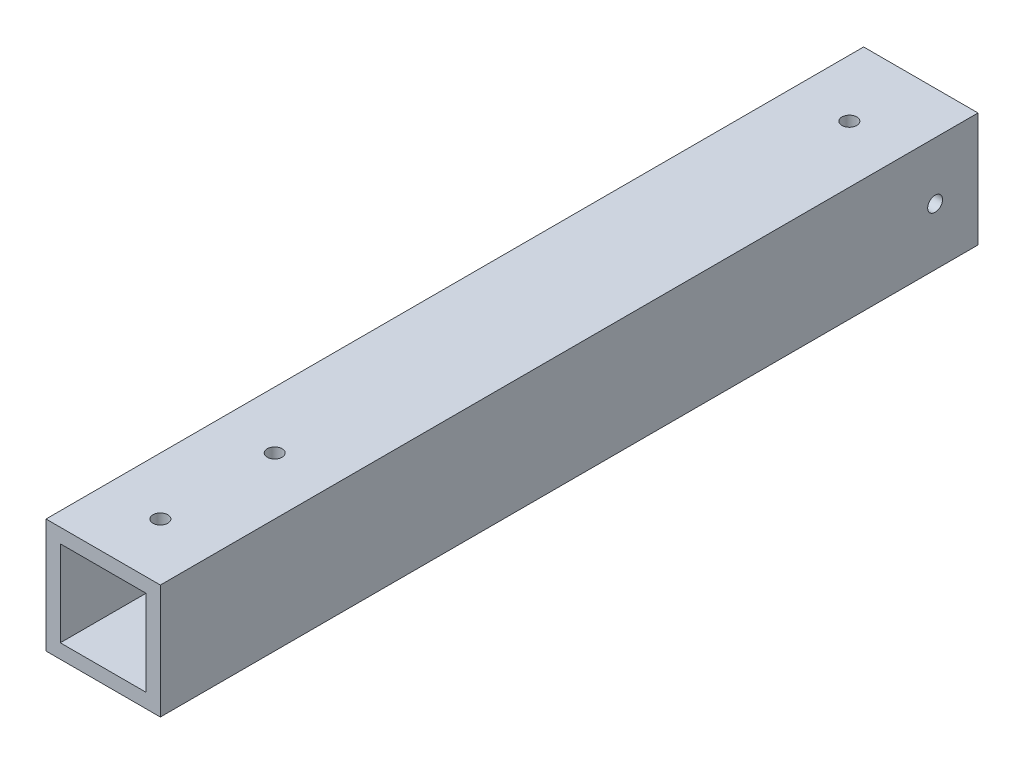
from build123d import *

# Parameters (mm, degrees)
SKETCH1_W           = 50.8
SKETCH1_H           = 50.8
SKETCH1_W_2         = 38.1
SKETCH1_H_2         = 38.1
BOSS_EXTRUDE1_DEPTH = 363.22
SKETCH3_R           = 3.302
HOLD_DOWN_DEPTH     = 371.256733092
SKETCH4_R           = 3.302
CUT_EXTRUDE1_DEPTH  = 371.256733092
SKETCH5_R           = 3.302
CUT_EXTRUDE2_DEPTH  = 371.256733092


with BuildPart() as part:
    # Sketch1 → Boss-Extrude1 (new body)
    with BuildSketch(Plane.XY):
        with Locations((25.4, 25.4)):
            Rectangle(SKETCH1_W, SKETCH1_H)
        with Locations((25.4, 25.4)):
            Rectangle(SKETCH1_W_2, SKETCH1_H_2, mode=Mode.SUBTRACT)
    extrude(amount=-BOSS_EXTRUDE1_DEPTH)

    # Sketch3 → hold down (cut, through all)
    with BuildSketch(Plane(origin=(0, 50.8, 0), x_dir=(1, 0, 0), z_dir=(0, 1, 0))):
        with Locations(Location((25.4, 25.4, 0), (0, 0, 270))):
            Circle(SKETCH3_R)
        with Locations(Location((25.4, 76.2, 0), (0, 0, 270))):
            Circle(SKETCH3_R)
    extrude(amount=-HOLD_DOWN_DEPTH, mode=Mode.SUBTRACT)

    # Sketch4 → Cut-Extrude1 (cut, through all)
    with BuildSketch(Plane(origin=(50.8, 0, 0), x_dir=(0, 0, -1), z_dir=(1, 0, 0))):
        with Locations((344.17, 25.4)):
            Circle(SKETCH4_R)
    extrude(amount=-CUT_EXTRUDE1_DEPTH, mode=Mode.SUBTRACT)

    # Sketch5 → Cut-Extrude2 (cut, through all)
    with BuildSketch(Plane(origin=(0, 50.8, 0), x_dir=(1, 0, 0), z_dir=(0, 1, 0))):
        with Locations(Location((25.4, 331.47, 0), (0, 0, 270))):
            Circle(SKETCH5_R)
    extrude(amount=-CUT_EXTRUDE2_DEPTH, mode=Mode.SUBTRACT)


solid = part.part
